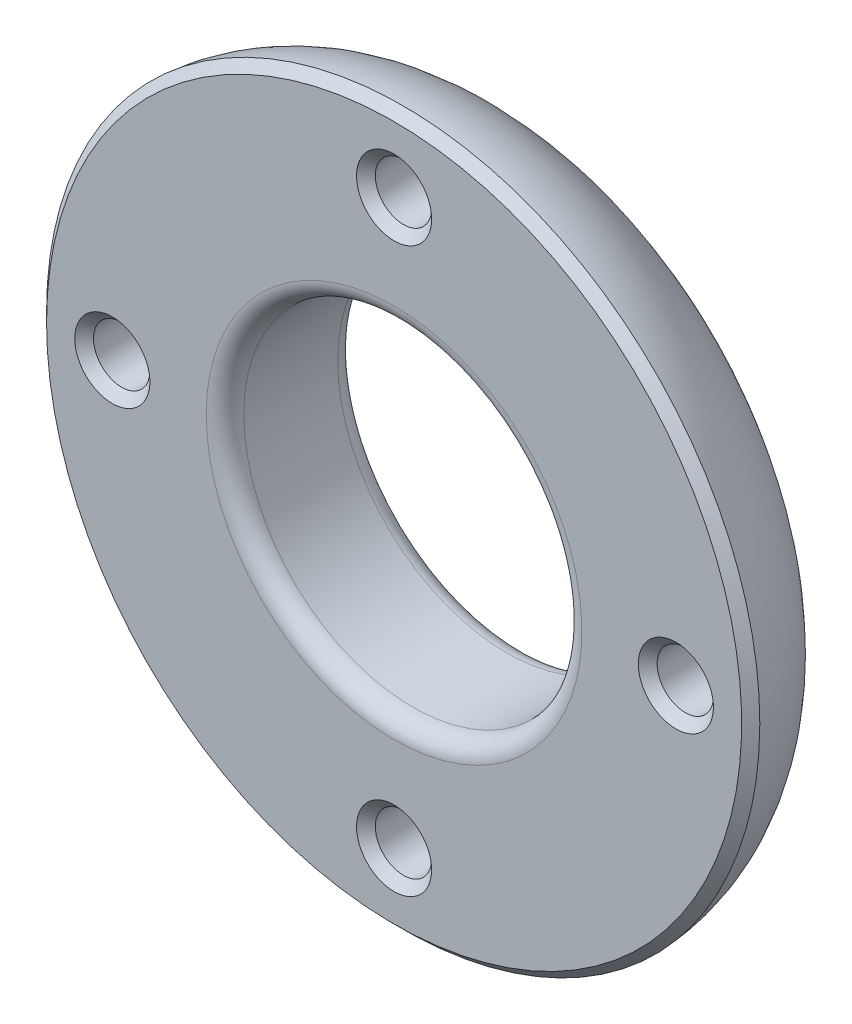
ISO-10303-21;
HEADER;
FILE_DESCRIPTION(('STEP AP214'),'2;1');
FILE_NAME('part.step','',(''),(''),'','','');
FILE_SCHEMA(('AUTOMOTIVE_DESIGN { 1 0 10303 214 1 1 1 1 }'));
ENDSEC;
DATA;
#1=APPLICATION_CONTEXT('core data for automotive mechanical design processes');
#2=APPLICATION_PROTOCOL_DEFINITION('international standard','automotive_design',2000,#1);
#3=PRODUCT_CONTEXT('',#1,'mechanical');
#4=PRODUCT('Part','Part','',(#3));
#5=PRODUCT_RELATED_PRODUCT_CATEGORY('part','',(#4));
#6=PRODUCT_DEFINITION_FORMATION('','',#4);
#7=PRODUCT_DEFINITION_CONTEXT('part definition',#1,'design');
#8=PRODUCT_DEFINITION('design','',#6,#7);
#9=PRODUCT_DEFINITION_SHAPE('','',#8);
#10=(LENGTH_UNIT() NAMED_UNIT(*) SI_UNIT(.MILLI.,.METRE.));
#11=(NAMED_UNIT(*) PLANE_ANGLE_UNIT() SI_UNIT($,.RADIAN.));
#12=(NAMED_UNIT(*) SI_UNIT($,.STERADIAN.) SOLID_ANGLE_UNIT());
#13=UNCERTAINTY_MEASURE_WITH_UNIT(LENGTH_MEASURE(1.E-05),#10,'distance_accuracy_value','');
#14=(GEOMETRIC_REPRESENTATION_CONTEXT(3) GLOBAL_UNCERTAINTY_ASSIGNED_CONTEXT((#13)) GLOBAL_UNIT_ASSIGNED_CONTEXT((#10,
#11,#12)) REPRESENTATION_CONTEXT('',''));
#15=CARTESIAN_POINT('',(0.,0.,0.));
#16=DIRECTION('',(0.,0.,1.));
#17=DIRECTION('',(1.,0.,0.));
#18=AXIS2_PLACEMENT_3D('',#15,#16,#17);
#19=CARTESIAN_POINT('',(0.,4.5,-1.75));
#20=DIRECTION('',(0.,0.,1.));
#21=DIRECTION('',(1.,0.,0.));
#22=AXIS2_PLACEMENT_3D('',#19,#20,#21);
#23=PLANE('',#22);
#24=CARTESIAN_POINT('',(0.,0.,-1.75));
#25=DIRECTION('',(0.,0.,1.));
#26=DIRECTION('',(1.,0.,0.));
#27=AXIS2_PLACEMENT_3D('',#24,#25,#26);
#28=CIRCLE('',#27,5.);
#29=CARTESIAN_POINT('',(5.,0.,-1.75));
#30=VERTEX_POINT('',#29);
#31=EDGE_CURVE('E91',#30,#30,#28,.T.);
#32=ORIENTED_EDGE('',*,*,#31,.T.);
#33=EDGE_LOOP('',(#32));
#34=FACE_BOUND('',#33,.T.);
#35=CARTESIAN_POINT('',(0.,0.,-1.75));
#36=DIRECTION('',(0.,0.,1.));
#37=DIRECTION('',(1.,0.,0.));
#38=AXIS2_PLACEMENT_3D('',#35,#36,#37);
#39=CIRCLE('',#38,6.);
#40=CARTESIAN_POINT('',(6.,0.,-1.75));
#41=VERTEX_POINT('',#40);
#42=EDGE_CURVE('E103',#41,#41,#39,.T.);
#43=ORIENTED_EDGE('',*,*,#42,.F.);
#44=EDGE_LOOP('',(#43));
#45=FACE_BOUND('',#44,.T.);
#46=ADVANCED_FACE('F29',(#34,#45),#23,.F.);
#47=CARTESIAN_POINT('',(0.,0.,1.75));
#48=DIRECTION('',(0.,0.,1.));
#49=DIRECTION('',(1.,0.,0.));
#50=AXIS2_PLACEMENT_3D('',#47,#48,#49);
#51=TOROIDAL_SURFACE('',#50,6.,3.5);
#52=CARTESIAN_POINT('',(0.,0.,1.50835193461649));
#53=DIRECTION('',(0.,0.,1.));
#54=DIRECTION('',(1.,0.,0.));
#55=AXIS2_PLACEMENT_3D('',#52,#53,#54);
#56=CIRCLE('',#55,9.49164806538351);
#57=CARTESIAN_POINT('',(9.49164806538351,0.,1.50835193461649));
#58=VERTEX_POINT('',#57);
#59=EDGE_CURVE('E10',#58,#58,#56,.F.);
#60=ORIENTED_EDGE('',*,*,#59,.T.);
#61=EDGE_LOOP('',(#60));
#62=FACE_BOUND('',#61,.T.);
#63=ORIENTED_EDGE('',*,*,#42,.T.);
#64=EDGE_LOOP('',(#63));
#65=FACE_BOUND('',#64,.T.);
#66=ADVANCED_FACE('F107',(#62,#65),#51,.T.);
#67=CARTESIAN_POINT('',(0.,4.5,1.75));
#68=DIRECTION('',(0.,0.,-1.));
#69=DIRECTION('',(-1.,0.,0.));
#70=AXIS2_PLACEMENT_3D('',#67,#68,#69);
#71=PLANE('',#70);
#72=CARTESIAN_POINT('',(0.,-7.5,1.75));
#73=DIRECTION('',(0.,0.,-1.));
#74=DIRECTION('',(-1.,0.,0.));
#75=AXIS2_PLACEMENT_3D('',#72,#73,#74);
#76=CIRCLE('',#75,1.);
#77=CARTESIAN_POINT('',(-1.00000000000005,-7.5,1.75));
#78=VERTEX_POINT('',#77);
#79=EDGE_CURVE('E70',#78,#78,#76,.T.);
#80=ORIENTED_EDGE('',*,*,#79,.T.);
#81=EDGE_LOOP('',(#80));
#82=FACE_BOUND('',#81,.T.);
#83=CARTESIAN_POINT('',(7.5,0.,1.75));
#84=DIRECTION('',(0.,0.,-1.));
#85=DIRECTION('',(-1.,0.,0.));
#86=AXIS2_PLACEMENT_3D('',#83,#84,#85);
#87=CIRCLE('',#86,1.);
#88=CARTESIAN_POINT('',(6.5,0.,1.75));
#89=VERTEX_POINT('',#88);
#90=EDGE_CURVE('E73',#89,#89,#87,.T.);
#91=ORIENTED_EDGE('',*,*,#90,.T.);
#92=EDGE_LOOP('',(#91));
#93=FACE_BOUND('',#92,.T.);
#94=CARTESIAN_POINT('',(-7.5,0.,1.75));
#95=DIRECTION('',(0.,0.,-1.));
#96=DIRECTION('',(-1.,0.,0.));
#97=AXIS2_PLACEMENT_3D('',#94,#95,#96);
#98=CIRCLE('',#97,1.);
#99=CARTESIAN_POINT('',(-8.5,0.,1.75));
#100=VERTEX_POINT('',#99);
#101=EDGE_CURVE('E76',#100,#100,#98,.T.);
#102=ORIENTED_EDGE('',*,*,#101,.T.);
#103=EDGE_LOOP('',(#102));
#104=FACE_BOUND('',#103,.T.);
#105=CARTESIAN_POINT('',(0.,7.5,1.75));
#106=DIRECTION('',(0.,0.,-1.));
#107=DIRECTION('',(-1.,0.,0.));
#108=AXIS2_PLACEMENT_3D('',#105,#106,#107);
#109=CIRCLE('',#108,1.);
#110=CARTESIAN_POINT('',(-1.,7.5,1.75));
#111=VERTEX_POINT('',#110);
#112=EDGE_CURVE('E79',#111,#111,#109,.T.);
#113=ORIENTED_EDGE('',*,*,#112,.T.);
#114=EDGE_LOOP('',(#113));
#115=FACE_BOUND('',#114,.T.);
#116=CARTESIAN_POINT('',(0.,0.,1.75));
#117=DIRECTION('',(0.,0.,-1.));
#118=DIRECTION('',(-1.,0.,0.));
#119=AXIS2_PLACEMENT_3D('',#116,#117,#118);
#120=CIRCLE('',#119,9.25);
#121=CARTESIAN_POINT('',(-9.25,0.,1.75));
#122=VERTEX_POINT('',#121);
#123=EDGE_CURVE('E82',#122,#122,#120,.F.);
#124=ORIENTED_EDGE('',*,*,#123,.T.);
#125=EDGE_LOOP('',(#124));
#126=FACE_BOUND('',#125,.T.);
#127=CARTESIAN_POINT('',(0.,0.,1.75));
#128=DIRECTION('',(0.,0.,-1.));
#129=DIRECTION('',(-1.,0.,0.));
#130=AXIS2_PLACEMENT_3D('',#127,#128,#129);
#131=CIRCLE('',#130,5.);
#132=CARTESIAN_POINT('',(-5.,0.,1.75));
#133=VERTEX_POINT('',#132);
#134=EDGE_CURVE('E94',#133,#133,#131,.T.);
#135=ORIENTED_EDGE('',*,*,#134,.T.);
#136=EDGE_LOOP('',(#135));
#137=FACE_BOUND('',#136,.T.);
#138=ADVANCED_FACE('F115',(#82,#93,#104,#115,#126,#137),#71,.F.);
#139=CARTESIAN_POINT('',(0.,0.,1.75));
#140=DIRECTION('',(0.,0.,1.));
#141=DIRECTION('',(1.,0.,0.));
#142=AXIS2_PLACEMENT_3D('',#139,#140,#141);
#143=CYLINDRICAL_SURFACE('',#142,4.5);
#144=CARTESIAN_POINT('',(0.,0.,1.25));
#145=DIRECTION('',(0.,0.,-1.));
#146=DIRECTION('',(-1.,0.,0.));
#147=AXIS2_PLACEMENT_3D('',#144,#145,#146);
#148=CIRCLE('',#147,4.5);
#149=CARTESIAN_POINT('',(-4.5,0.,1.25));
#150=VERTEX_POINT('',#149);
#151=EDGE_CURVE('E97',#150,#150,#148,.F.);
#152=ORIENTED_EDGE('',*,*,#151,.T.);
#153=EDGE_LOOP('',(#152));
#154=FACE_BOUND('',#153,.T.);
#155=CARTESIAN_POINT('',(0.,0.,-1.25));
#156=DIRECTION('',(0.,0.,1.));
#157=DIRECTION('',(1.,0.,0.));
#158=AXIS2_PLACEMENT_3D('',#155,#156,#157);
#159=CIRCLE('',#158,4.5);
#160=CARTESIAN_POINT('',(4.5,0.,-1.25));
#161=VERTEX_POINT('',#160);
#162=EDGE_CURVE('E100',#161,#161,#159,.F.);
#163=ORIENTED_EDGE('',*,*,#162,.T.);
#164=EDGE_LOOP('',(#163));
#165=FACE_BOUND('',#164,.T.);
#166=ADVANCED_FACE('F168',(#154,#165),#143,.F.);
#167=CARTESIAN_POINT('',(0.,7.5,-0.749999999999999));
#168=DIRECTION('',(0.,0.,1.));
#169=DIRECTION('',(1.,0.,0.));
#170=AXIS2_PLACEMENT_3D('',#167,#168,#169);
#171=CYLINDRICAL_SURFACE('',#170,0.75);
#172=CARTESIAN_POINT('',(0.,7.5,1.5));
#173=DIRECTION('',(0.,0.,-1.));
#174=DIRECTION('',(-1.,0.,0.));
#175=AXIS2_PLACEMENT_3D('',#172,#173,#174);
#176=CIRCLE('',#175,0.75);
#177=CARTESIAN_POINT('',(-0.75,7.5,1.5));
#178=VERTEX_POINT('',#177);
#179=EDGE_CURVE('E40',#178,#178,#176,.F.);
#180=ORIENTED_EDGE('',*,*,#179,.T.);
#181=EDGE_LOOP('',(#180));
#182=FACE_BOUND('',#181,.T.);
#183=CARTESIAN_POINT('',(0.,7.5,-0.499999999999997));
#184=DIRECTION('',(0.,0.,1.));
#185=DIRECTION('',(1.,0.,0.));
#186=AXIS2_PLACEMENT_3D('',#183,#184,#185);
#187=CIRCLE('',#186,0.75);
#188=CARTESIAN_POINT('',(0.75,7.5,-0.499999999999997));
#189=VERTEX_POINT('',#188);
#190=EDGE_CURVE('E44',#189,#189,#187,.F.);
#191=ORIENTED_EDGE('',*,*,#190,.T.);
#192=EDGE_LOOP('',(#191));
#193=FACE_BOUND('',#192,.T.);
#194=ADVANCED_FACE('F165',(#182,#193),#171,.F.);
#195=CARTESIAN_POINT('',(0.,7.5,-0.749999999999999));
#196=DIRECTION('',(0.,0.,1.));
#197=DIRECTION('',(1.,0.,0.));
#198=AXIS2_PLACEMENT_3D('',#195,#196,#197);
#199=PLANE('',#198);
#200=CARTESIAN_POINT('',(0.,7.5,-0.749999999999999));
#201=DIRECTION('',(0.,0.,1.));
#202=DIRECTION('',(1.,0.,0.));
#203=AXIS2_PLACEMENT_3D('',#200,#201,#202);
#204=CIRCLE('',#203,0.499999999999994);
#205=CARTESIAN_POINT('',(0.499999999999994,7.5,-0.749999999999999));
#206=VERTEX_POINT('',#205);
#207=EDGE_CURVE('E36',#206,#206,#204,.T.);
#208=ORIENTED_EDGE('',*,*,#207,.T.);
#209=EDGE_LOOP('',(#208));
#210=FACE_BOUND('',#209,.T.);
#211=ADVANCED_FACE('F167',(#210),#199,.T.);
#212=CARTESIAN_POINT('',(7.5,0.,-0.749999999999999));
#213=DIRECTION('',(0.,0.,1.));
#214=DIRECTION('',(1.,0.,0.));
#215=AXIS2_PLACEMENT_3D('',#212,#213,#214);
#216=CYLINDRICAL_SURFACE('',#215,0.75);
#217=CARTESIAN_POINT('',(7.5,0.,1.5));
#218=DIRECTION('',(0.,0.,-1.));
#219=DIRECTION('',(-1.,0.,0.));
#220=AXIS2_PLACEMENT_3D('',#217,#218,#219);
#221=CIRCLE('',#220,0.75);
#222=CARTESIAN_POINT('',(6.75,0.,1.5));
#223=VERTEX_POINT('',#222);
#224=EDGE_CURVE('E61',#223,#223,#221,.F.);
#225=ORIENTED_EDGE('',*,*,#224,.T.);
#226=EDGE_LOOP('',(#225));
#227=FACE_BOUND('',#226,.T.);
#228=CARTESIAN_POINT('',(7.5,0.,-0.499999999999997));
#229=DIRECTION('',(0.,0.,1.));
#230=DIRECTION('',(1.,0.,0.));
#231=AXIS2_PLACEMENT_3D('',#228,#229,#230);
#232=CIRCLE('',#231,0.75);
#233=CARTESIAN_POINT('',(8.25,0.,-0.499999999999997));
#234=VERTEX_POINT('',#233);
#235=EDGE_CURVE('E64',#234,#234,#232,.F.);
#236=ORIENTED_EDGE('',*,*,#235,.T.);
#237=EDGE_LOOP('',(#236));
#238=FACE_BOUND('',#237,.T.);
#239=ADVANCED_FACE('F175',(#227,#238),#216,.F.);
#240=CARTESIAN_POINT('',(7.5,0.,-0.749999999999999));
#241=DIRECTION('',(0.,0.,1.));
#242=DIRECTION('',(1.,0.,0.));
#243=AXIS2_PLACEMENT_3D('',#240,#241,#242);
#244=PLANE('',#243);
#245=CARTESIAN_POINT('',(7.5,0.,-0.749999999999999));
#246=DIRECTION('',(0.,0.,1.));
#247=DIRECTION('',(1.,0.,0.));
#248=AXIS2_PLACEMENT_3D('',#245,#246,#247);
#249=CIRCLE('',#248,0.499999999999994);
#250=CARTESIAN_POINT('',(7.99999999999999,0.,-0.749999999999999));
#251=VERTEX_POINT('',#250);
#252=EDGE_CURVE('E58',#251,#251,#249,.T.);
#253=ORIENTED_EDGE('',*,*,#252,.T.);
#254=EDGE_LOOP('',(#253));
#255=FACE_BOUND('',#254,.T.);
#256=ADVANCED_FACE('F227',(#255),#244,.T.);
#257=CARTESIAN_POINT('',(0.,-7.5,-0.749999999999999));
#258=DIRECTION('',(0.,0.,1.));
#259=DIRECTION('',(1.,0.,0.));
#260=AXIS2_PLACEMENT_3D('',#257,#258,#259);
#261=CYLINDRICAL_SURFACE('',#260,0.75);
#262=CARTESIAN_POINT('',(0.,-7.5,1.5));
#263=DIRECTION('',(0.,0.,-1.));
#264=DIRECTION('',(-1.,0.,0.));
#265=AXIS2_PLACEMENT_3D('',#262,#263,#264);
#266=CIRCLE('',#265,0.75);
#267=CARTESIAN_POINT('',(-0.750000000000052,-7.5,1.5));
#268=VERTEX_POINT('',#267);
#269=EDGE_CURVE('E85',#268,#268,#266,.F.);
#270=ORIENTED_EDGE('',*,*,#269,.T.);
#271=EDGE_LOOP('',(#270));
#272=FACE_BOUND('',#271,.T.);
#273=CARTESIAN_POINT('',(0.,-7.5,-0.499999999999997));
#274=DIRECTION('',(0.,0.,1.));
#275=DIRECTION('',(1.,0.,0.));
#276=AXIS2_PLACEMENT_3D('',#273,#274,#275);
#277=CIRCLE('',#276,0.75);
#278=CARTESIAN_POINT('',(0.749999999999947,-7.5,-0.499999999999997));
#279=VERTEX_POINT('',#278);
#280=EDGE_CURVE('E88',#279,#279,#277,.F.);
#281=ORIENTED_EDGE('',*,*,#280,.T.);
#282=EDGE_LOOP('',(#281));
#283=FACE_BOUND('',#282,.T.);
#284=ADVANCED_FACE('F223',(#272,#283),#261,.F.);
#285=CARTESIAN_POINT('',(0.,-7.5,-0.749999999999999));
#286=DIRECTION('',(0.,0.,1.));
#287=DIRECTION('',(1.,0.,0.));
#288=AXIS2_PLACEMENT_3D('',#285,#286,#287);
#289=PLANE('',#288);
#290=CARTESIAN_POINT('',(0.,-7.5,-0.749999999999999));
#291=DIRECTION('',(0.,0.,1.));
#292=DIRECTION('',(1.,0.,0.));
#293=AXIS2_PLACEMENT_3D('',#290,#291,#292);
#294=CIRCLE('',#293,0.499999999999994);
#295=CARTESIAN_POINT('',(0.499999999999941,-7.5,-0.749999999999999));
#296=VERTEX_POINT('',#295);
#297=EDGE_CURVE('E67',#296,#296,#294,.T.);
#298=ORIENTED_EDGE('',*,*,#297,.T.);
#299=EDGE_LOOP('',(#298));
#300=FACE_BOUND('',#299,.T.);
#301=ADVANCED_FACE('F210',(#300),#289,.T.);
#302=CARTESIAN_POINT('',(-7.5,0.,-0.749999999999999));
#303=DIRECTION('',(0.,0.,1.));
#304=DIRECTION('',(1.,0.,0.));
#305=AXIS2_PLACEMENT_3D('',#302,#303,#304);
#306=CYLINDRICAL_SURFACE('',#305,0.75);
#307=CARTESIAN_POINT('',(-7.5,0.,1.5));
#308=DIRECTION('',(0.,0.,-1.));
#309=DIRECTION('',(-1.,0.,0.));
#310=AXIS2_PLACEMENT_3D('',#307,#308,#309);
#311=CIRCLE('',#310,0.75);
#312=CARTESIAN_POINT('',(-8.25,0.,1.5));
#313=VERTEX_POINT('',#312);
#314=EDGE_CURVE('E52',#313,#313,#311,.F.);
#315=ORIENTED_EDGE('',*,*,#314,.T.);
#316=EDGE_LOOP('',(#315));
#317=FACE_BOUND('',#316,.T.);
#318=CARTESIAN_POINT('',(-7.5,0.,-0.499999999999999));
#319=DIRECTION('',(0.,0.,1.));
#320=DIRECTION('',(1.,0.,0.));
#321=AXIS2_PLACEMENT_3D('',#318,#319,#320);
#322=CIRCLE('',#321,0.75);
#323=CARTESIAN_POINT('',(-6.75,0.,-0.499999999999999));
#324=VERTEX_POINT('',#323);
#325=EDGE_CURVE('E55',#324,#324,#322,.F.);
#326=ORIENTED_EDGE('',*,*,#325,.T.);
#327=EDGE_LOOP('',(#326));
#328=FACE_BOUND('',#327,.T.);
#329=ADVANCED_FACE('F207',(#317,#328),#306,.F.);
#330=CARTESIAN_POINT('',(-7.5,0.,-0.749999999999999));
#331=DIRECTION('',(0.,0.,1.));
#332=DIRECTION('',(1.,0.,0.));
#333=AXIS2_PLACEMENT_3D('',#330,#331,#332);
#334=PLANE('',#333);
#335=CARTESIAN_POINT('',(-7.5,0.,-0.749999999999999));
#336=DIRECTION('',(0.,0.,1.));
#337=DIRECTION('',(1.,0.,0.));
#338=AXIS2_PLACEMENT_3D('',#335,#336,#337);
#339=CIRCLE('',#338,0.499999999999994);
#340=CARTESIAN_POINT('',(-7.00000000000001,0.,-0.749999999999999));
#341=VERTEX_POINT('',#340);
#342=EDGE_CURVE('E49',#341,#341,#339,.T.);
#343=ORIENTED_EDGE('',*,*,#342,.T.);
#344=EDGE_LOOP('',(#343));
#345=FACE_BOUND('',#344,.T.);
#346=ADVANCED_FACE('F123',(#345),#334,.T.);
#347=CARTESIAN_POINT('',(0.,0.,1.25));
#348=DIRECTION('',(0.,0.,-1.));
#349=DIRECTION('',(-1.,0.,0.));
#350=AXIS2_PLACEMENT_3D('',#347,#348,#349);
#351=TOROIDAL_SURFACE('',#350,5.,0.5);
#352=ORIENTED_EDGE('',*,*,#134,.F.);
#353=EDGE_LOOP('',(#352));
#354=FACE_BOUND('',#353,.T.);
#355=ORIENTED_EDGE('',*,*,#151,.F.);
#356=EDGE_LOOP('',(#355));
#357=FACE_BOUND('',#356,.T.);
#358=ADVANCED_FACE('F119',(#354,#357),#351,.T.);
#359=CARTESIAN_POINT('',(0.,0.,-1.25));
#360=DIRECTION('',(0.,0.,1.));
#361=DIRECTION('',(1.,0.,0.));
#362=AXIS2_PLACEMENT_3D('',#359,#360,#361);
#363=TOROIDAL_SURFACE('',#362,5.,0.5);
#364=ORIENTED_EDGE('',*,*,#162,.F.);
#365=EDGE_LOOP('',(#364));
#366=FACE_BOUND('',#365,.T.);
#367=ORIENTED_EDGE('',*,*,#31,.F.);
#368=EDGE_LOOP('',(#367));
#369=FACE_BOUND('',#368,.T.);
#370=ADVANCED_FACE('F122',(#366,#369),#363,.T.);
#371=CARTESIAN_POINT('',(0.,-7.5,1.5));
#372=DIRECTION('',(0.,0.,1.));
#373=DIRECTION('',(1.,0.,0.));
#374=AXIS2_PLACEMENT_3D('',#371,#372,#373);
#375=CONICAL_SURFACE('',#374,0.75,0.785398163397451);
#376=ORIENTED_EDGE('',*,*,#79,.F.);
#377=EDGE_LOOP('',(#376));
#378=FACE_BOUND('',#377,.T.);
#379=ORIENTED_EDGE('',*,*,#269,.F.);
#380=EDGE_LOOP('',(#379));
#381=FACE_BOUND('',#380,.T.);
#382=ADVANCED_FACE('F127',(#378,#381),#375,.F.);
#383=CARTESIAN_POINT('',(0.,-7.5,-0.749999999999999));
#384=DIRECTION('',(0.,0.,1.));
#385=DIRECTION('',(1.,0.,0.));
#386=AXIS2_PLACEMENT_3D('',#383,#384,#385);
#387=CONICAL_SURFACE('',#386,0.499999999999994,0.785398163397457);
#388=ORIENTED_EDGE('',*,*,#280,.F.);
#389=EDGE_LOOP('',(#388));
#390=FACE_BOUND('',#389,.T.);
#391=ORIENTED_EDGE('',*,*,#297,.F.);
#392=EDGE_LOOP('',(#391));
#393=FACE_BOUND('',#392,.T.);
#394=ADVANCED_FACE('F131',(#390,#393),#387,.F.);
#395=CARTESIAN_POINT('',(7.5,0.,1.5));
#396=DIRECTION('',(0.,0.,1.));
#397=DIRECTION('',(1.,0.,0.));
#398=AXIS2_PLACEMENT_3D('',#395,#396,#397);
#399=CONICAL_SURFACE('',#398,0.75,0.785398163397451);
#400=ORIENTED_EDGE('',*,*,#90,.F.);
#401=EDGE_LOOP('',(#400));
#402=FACE_BOUND('',#401,.T.);
#403=ORIENTED_EDGE('',*,*,#224,.F.);
#404=EDGE_LOOP('',(#403));
#405=FACE_BOUND('',#404,.T.);
#406=ADVANCED_FACE('F135',(#402,#405),#399,.F.);
#407=CARTESIAN_POINT('',(7.5,0.,-0.749999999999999));
#408=DIRECTION('',(0.,0.,1.));
#409=DIRECTION('',(1.,0.,0.));
#410=AXIS2_PLACEMENT_3D('',#407,#408,#409);
#411=CONICAL_SURFACE('',#410,0.499999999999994,0.785398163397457);
#412=ORIENTED_EDGE('',*,*,#235,.F.);
#413=EDGE_LOOP('',(#412));
#414=FACE_BOUND('',#413,.T.);
#415=ORIENTED_EDGE('',*,*,#252,.F.);
#416=EDGE_LOOP('',(#415));
#417=FACE_BOUND('',#416,.T.);
#418=ADVANCED_FACE('F139',(#414,#417),#411,.F.);
#419=CARTESIAN_POINT('',(-7.5,0.,1.5));
#420=DIRECTION('',(0.,0.,1.));
#421=DIRECTION('',(1.,0.,0.));
#422=AXIS2_PLACEMENT_3D('',#419,#420,#421);
#423=CONICAL_SURFACE('',#422,0.75,0.785398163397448);
#424=ORIENTED_EDGE('',*,*,#101,.F.);
#425=EDGE_LOOP('',(#424));
#426=FACE_BOUND('',#425,.T.);
#427=ORIENTED_EDGE('',*,*,#314,.F.);
#428=EDGE_LOOP('',(#427));
#429=FACE_BOUND('',#428,.T.);
#430=ADVANCED_FACE('F143',(#426,#429),#423,.F.);
#431=CARTESIAN_POINT('',(-7.5,0.,-0.749999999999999));
#432=DIRECTION('',(0.,0.,1.));
#433=DIRECTION('',(1.,0.,0.));
#434=AXIS2_PLACEMENT_3D('',#431,#432,#433);
#435=CONICAL_SURFACE('',#434,0.499999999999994,0.785398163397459);
#436=ORIENTED_EDGE('',*,*,#325,.F.);
#437=EDGE_LOOP('',(#436));
#438=FACE_BOUND('',#437,.T.);
#439=ORIENTED_EDGE('',*,*,#342,.F.);
#440=EDGE_LOOP('',(#439));
#441=FACE_BOUND('',#440,.T.);
#442=ADVANCED_FACE('F147',(#438,#441),#435,.F.);
#443=CARTESIAN_POINT('',(0.,7.5,1.5));
#444=DIRECTION('',(0.,0.,1.));
#445=DIRECTION('',(1.,0.,0.));
#446=AXIS2_PLACEMENT_3D('',#443,#444,#445);
#447=CONICAL_SURFACE('',#446,0.75,0.78539816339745);
#448=ORIENTED_EDGE('',*,*,#112,.F.);
#449=EDGE_LOOP('',(#448));
#450=FACE_BOUND('',#449,.T.);
#451=ORIENTED_EDGE('',*,*,#179,.F.);
#452=EDGE_LOOP('',(#451));
#453=FACE_BOUND('',#452,.T.);
#454=ADVANCED_FACE('F151',(#450,#453),#447,.F.);
#455=CARTESIAN_POINT('',(0.,7.5,-0.749999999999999));
#456=DIRECTION('',(0.,0.,1.));
#457=DIRECTION('',(1.,0.,0.));
#458=AXIS2_PLACEMENT_3D('',#455,#456,#457);
#459=CONICAL_SURFACE('',#458,0.499999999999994,0.785398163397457);
#460=ORIENTED_EDGE('',*,*,#190,.F.);
#461=EDGE_LOOP('',(#460));
#462=FACE_BOUND('',#461,.T.);
#463=ORIENTED_EDGE('',*,*,#207,.F.);
#464=EDGE_LOOP('',(#463));
#465=FACE_BOUND('',#464,.T.);
#466=ADVANCED_FACE('F154',(#462,#465),#459,.F.);
#467=CARTESIAN_POINT('',(0.,0.,1.75));
#468=DIRECTION('',(0.,0.,-1.));
#469=DIRECTION('',(-1.,0.,0.));
#470=AXIS2_PLACEMENT_3D('',#467,#468,#469);
#471=CONICAL_SURFACE('',#470,9.25,0.785398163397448);
#472=ORIENTED_EDGE('',*,*,#59,.F.);
#473=EDGE_LOOP('',(#472));
#474=FACE_BOUND('',#473,.T.);
#475=ORIENTED_EDGE('',*,*,#123,.F.);
#476=EDGE_LOOP('',(#475));
#477=FACE_BOUND('',#476,.T.);
#478=ADVANCED_FACE('F31',(#474,#477),#471,.T.);
#479=CLOSED_SHELL('',(#46,#66,#138,#166,#194,#211,#239,#256,#284,#301,#329,#346,#358,#370,#382,
#394,#406,#418,#430,#442,#454,#466,#478));
#480=MANIFOLD_SOLID_BREP('B2',#479);
#481=ADVANCED_BREP_SHAPE_REPRESENTATION('',(#18,#480),#14);
#482=SHAPE_DEFINITION_REPRESENTATION(#9,#481);
ENDSEC;
END-ISO-10303-21;
